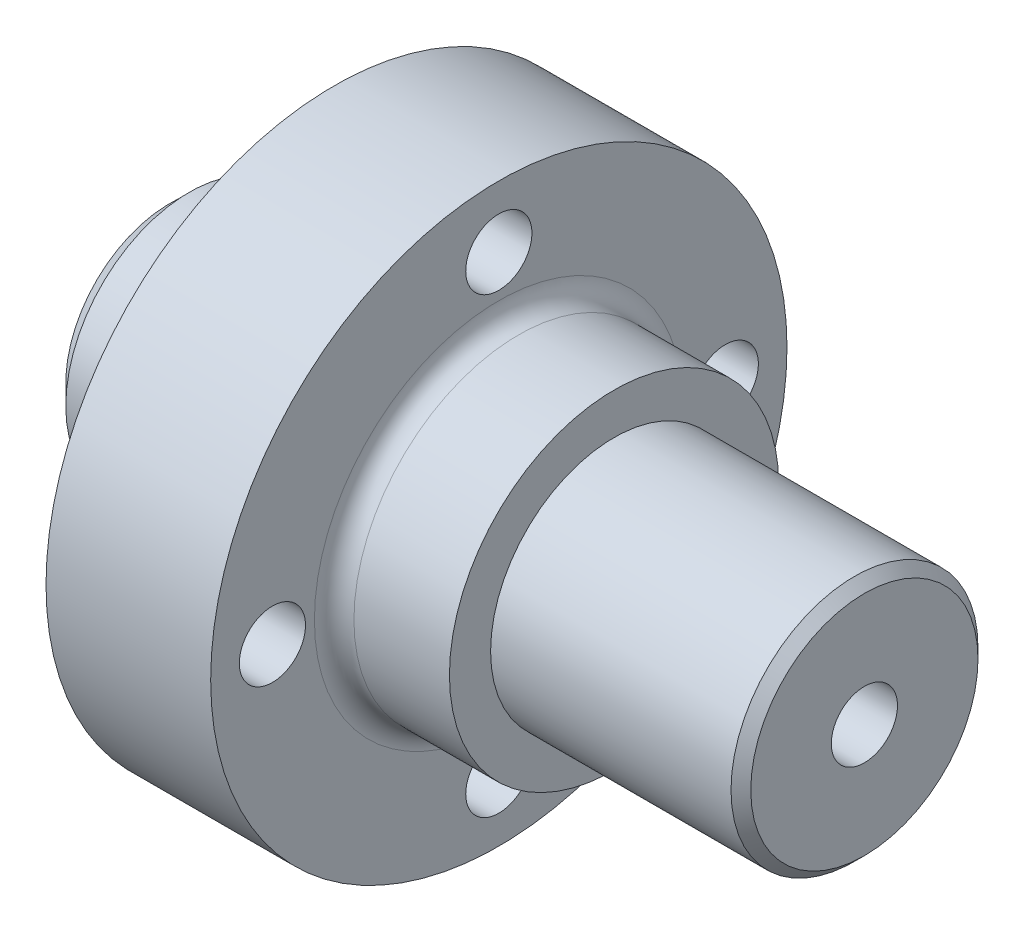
ISO-10303-21;
HEADER;
FILE_DESCRIPTION(('STEP AP214'),'2;1');
FILE_NAME('part.step','',(''),(''),'','','');
FILE_SCHEMA(('AUTOMOTIVE_DESIGN { 1 0 10303 214 1 1 1 1 }'));
ENDSEC;
DATA;
#1=APPLICATION_CONTEXT('core data for automotive mechanical design processes');
#2=APPLICATION_PROTOCOL_DEFINITION('international standard','automotive_design',2000,#1);
#3=PRODUCT_CONTEXT('',#1,'mechanical');
#4=PRODUCT('Part','Part','',(#3));
#5=PRODUCT_RELATED_PRODUCT_CATEGORY('part','',(#4));
#6=PRODUCT_DEFINITION_FORMATION('','',#4);
#7=PRODUCT_DEFINITION_CONTEXT('part definition',#1,'design');
#8=PRODUCT_DEFINITION('design','',#6,#7);
#9=PRODUCT_DEFINITION_SHAPE('','',#8);
#10=(LENGTH_UNIT() NAMED_UNIT(*) SI_UNIT(.MILLI.,.METRE.));
#11=(NAMED_UNIT(*) PLANE_ANGLE_UNIT() SI_UNIT($,.RADIAN.));
#12=(NAMED_UNIT(*) SI_UNIT($,.STERADIAN.) SOLID_ANGLE_UNIT());
#13=UNCERTAINTY_MEASURE_WITH_UNIT(LENGTH_MEASURE(1.E-05),#10,'distance_accuracy_value','');
#14=(GEOMETRIC_REPRESENTATION_CONTEXT(3) GLOBAL_UNCERTAINTY_ASSIGNED_CONTEXT((#13)) GLOBAL_UNIT_ASSIGNED_CONTEXT((#10,
#11,#12)) REPRESENTATION_CONTEXT('',''));
#15=CARTESIAN_POINT('',(0.,0.,0.));
#16=DIRECTION('',(0.,0.,1.));
#17=DIRECTION('',(1.,0.,0.));
#18=AXIS2_PLACEMENT_3D('',#15,#16,#17);
#19=CARTESIAN_POINT('',(34.29,0.,0.));
#20=DIRECTION('',(1.,0.,0.));
#21=DIRECTION('',(0.,0.,-1.));
#22=AXIS2_PLACEMENT_3D('',#19,#20,#21);
#23=PLANE('',#22);
#24=CARTESIAN_POINT('',(34.29,0.,0.));
#25=DIRECTION('',(1.,0.,0.));
#26=DIRECTION('',(0.,0.,-1.));
#27=AXIS2_PLACEMENT_3D('',#24,#25,#26);
#28=CIRCLE('',#27,12.7);
#29=CARTESIAN_POINT('',(34.29,0.,-12.7));
#30=VERTEX_POINT('',#29);
#31=EDGE_CURVE('E61',#30,#30,#28,.T.);
#32=ORIENTED_EDGE('',*,*,#31,.T.);
#33=EDGE_LOOP('',(#32));
#34=FACE_BOUND('',#33,.T.);
#35=CARTESIAN_POINT('',(34.29,0.,0.));
#36=DIRECTION('',(1.,0.,0.));
#37=DIRECTION('',(0.,0.,-1.));
#38=AXIS2_PLACEMENT_3D('',#35,#36,#37);
#39=CIRCLE('',#38,9.525);
#40=CARTESIAN_POINT('',(34.29,0.,-9.525));
#41=VERTEX_POINT('',#40);
#42=EDGE_CURVE('E57',#41,#41,#39,.T.);
#43=ORIENTED_EDGE('',*,*,#42,.F.);
#44=EDGE_LOOP('',(#43));
#45=FACE_BOUND('',#44,.T.);
#46=ADVANCED_FACE('F37',(#34,#45),#23,.T.);
#47=CARTESIAN_POINT('',(25.4,0.,0.));
#48=DIRECTION('',(1.,0.,0.));
#49=DIRECTION('',(0.,0.,-1.));
#50=AXIS2_PLACEMENT_3D('',#47,#48,#49);
#51=PLANE('',#50);
#52=CARTESIAN_POINT('',(25.4,0.,0.));
#53=DIRECTION('',(1.,0.,0.));
#54=DIRECTION('',(0.,0.,-1.));
#55=AXIS2_PLACEMENT_3D('',#52,#53,#54);
#56=CIRCLE('',#55,14.224);
#57=CARTESIAN_POINT('',(25.4,0.,-14.224));
#58=VERTEX_POINT('',#57);
#59=EDGE_CURVE('E110',#58,#58,#56,.F.);
#60=ORIENTED_EDGE('',*,*,#59,.T.);
#61=EDGE_LOOP('',(#60));
#62=FACE_BOUND('',#61,.T.);
#63=CARTESIAN_POINT('',(25.4,0.,0.));
#64=DIRECTION('',(1.,0.,0.));
#65=DIRECTION('',(0.,0.,-1.));
#66=AXIS2_PLACEMENT_3D('',#63,#64,#65);
#67=CIRCLE('',#66,22.225);
#68=CARTESIAN_POINT('',(25.4,0.,-22.225));
#69=VERTEX_POINT('',#68);
#70=EDGE_CURVE('E93',#69,#69,#67,.T.);
#71=ORIENTED_EDGE('',*,*,#70,.T.);
#72=EDGE_LOOP('',(#71));
#73=FACE_BOUND('',#72,.T.);
#74=CARTESIAN_POINT('',(25.4,0.,-17.4625));
#75=DIRECTION('',(-1.,0.,0.));
#76=DIRECTION('',(0.,0.,1.));
#77=AXIS2_PLACEMENT_3D('',#74,#75,#76);
#78=CIRCLE('',#77,2.5527);
#79=CARTESIAN_POINT('',(25.4,0.,-14.9098));
#80=VERTEX_POINT('',#79);
#81=EDGE_CURVE('E89',#80,#80,#78,.T.);
#82=ORIENTED_EDGE('',*,*,#81,.T.);
#83=EDGE_LOOP('',(#82));
#84=FACE_BOUND('',#83,.T.);
#85=CARTESIAN_POINT('',(25.4,-17.4625,0.));
#86=DIRECTION('',(-1.,0.,0.));
#87=DIRECTION('',(0.,0.,1.));
#88=AXIS2_PLACEMENT_3D('',#85,#86,#87);
#89=CIRCLE('',#88,2.5527);
#90=CARTESIAN_POINT('',(25.4,-17.4625,2.5527));
#91=VERTEX_POINT('',#90);
#92=EDGE_CURVE('E83',#91,#91,#89,.T.);
#93=ORIENTED_EDGE('',*,*,#92,.T.);
#94=EDGE_LOOP('',(#93));
#95=FACE_BOUND('',#94,.T.);
#96=CARTESIAN_POINT('',(25.4,0.,17.4625));
#97=DIRECTION('',(-1.,0.,0.));
#98=DIRECTION('',(0.,0.,1.));
#99=AXIS2_PLACEMENT_3D('',#96,#97,#98);
#100=CIRCLE('',#99,2.5527);
#101=CARTESIAN_POINT('',(25.4,0.,20.0152));
#102=VERTEX_POINT('',#101);
#103=EDGE_CURVE('E77',#102,#102,#100,.T.);
#104=ORIENTED_EDGE('',*,*,#103,.T.);
#105=EDGE_LOOP('',(#104));
#106=FACE_BOUND('',#105,.T.);
#107=CARTESIAN_POINT('',(25.4,17.4625,0.));
#108=DIRECTION('',(-1.,0.,0.));
#109=DIRECTION('',(0.,0.,1.));
#110=AXIS2_PLACEMENT_3D('',#107,#108,#109);
#111=CIRCLE('',#110,2.5527);
#112=CARTESIAN_POINT('',(25.4,17.4625,2.5527));
#113=VERTEX_POINT('',#112);
#114=EDGE_CURVE('E71',#113,#113,#111,.T.);
#115=ORIENTED_EDGE('',*,*,#114,.T.);
#116=EDGE_LOOP('',(#115));
#117=FACE_BOUND('',#116,.T.);
#118=ADVANCED_FACE('F126',(#62,#73,#84,#95,#106,#117),#51,.T.);
#119=CARTESIAN_POINT('',(12.7,0.,0.));
#120=DIRECTION('',(-1.,0.,0.));
#121=DIRECTION('',(0.,0.,1.));
#122=AXIS2_PLACEMENT_3D('',#119,#120,#121);
#123=CYLINDRICAL_SURFACE('',#122,9.525);
#124=CARTESIAN_POINT('',(1.52400000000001,0.,0.));
#125=DIRECTION('',(1.,0.,0.));
#126=DIRECTION('',(0.,0.,-1.));
#127=AXIS2_PLACEMENT_3D('',#124,#125,#126);
#128=CIRCLE('',#127,9.525);
#129=CARTESIAN_POINT('',(1.52400000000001,0.,-9.525));
#130=VERTEX_POINT('',#129);
#131=EDGE_CURVE('E101',#130,#130,#128,.T.);
#132=ORIENTED_EDGE('',*,*,#131,.T.);
#133=EDGE_LOOP('',(#132));
#134=FACE_BOUND('',#133,.T.);
#135=CARTESIAN_POINT('',(12.7,0.,0.));
#136=DIRECTION('',(1.,0.,0.));
#137=DIRECTION('',(0.,0.,-1.));
#138=AXIS2_PLACEMENT_3D('',#135,#136,#137);
#139=CIRCLE('',#138,9.525);
#140=CARTESIAN_POINT('',(12.7,0.,-9.525));
#141=VERTEX_POINT('',#140);
#142=EDGE_CURVE('E96',#141,#141,#139,.T.);
#143=ORIENTED_EDGE('',*,*,#142,.F.);
#144=EDGE_LOOP('',(#143));
#145=FACE_BOUND('',#144,.T.);
#146=ADVANCED_FACE('F134',(#134,#145),#123,.T.);
#147=CARTESIAN_POINT('',(0.,0.,0.));
#148=DIRECTION('',(1.,0.,0.));
#149=DIRECTION('',(0.,0.,-1.));
#150=AXIS2_PLACEMENT_3D('',#147,#148,#149);
#151=PLANE('',#150);
#152=CARTESIAN_POINT('',(0.,0.,0.));
#153=DIRECTION('',(1.,0.,0.));
#154=DIRECTION('',(0.,0.,-1.));
#155=AXIS2_PLACEMENT_3D('',#152,#153,#154);
#156=CIRCLE('',#155,8.00099999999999);
#157=CARTESIAN_POINT('',(0.,0.,-8.00099999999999));
#158=VERTEX_POINT('',#157);
#159=EDGE_CURVE('E104',#158,#158,#156,.F.);
#160=ORIENTED_EDGE('',*,*,#159,.T.);
#161=EDGE_LOOP('',(#160));
#162=FACE_BOUND('',#161,.T.);
#163=ADVANCED_FACE('F166',(#162),#151,.F.);
#164=CARTESIAN_POINT('',(12.7,0.,0.));
#165=DIRECTION('',(1.,0.,0.));
#166=DIRECTION('',(0.,0.,-1.));
#167=AXIS2_PLACEMENT_3D('',#164,#165,#166);
#168=PLANE('',#167);
#169=CARTESIAN_POINT('',(12.7,17.4625,0.));
#170=DIRECTION('',(-1.,0.,0.));
#171=DIRECTION('',(0.,0.,1.));
#172=AXIS2_PLACEMENT_3D('',#169,#170,#171);
#173=CIRCLE('',#172,2.55269999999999);
#174=CARTESIAN_POINT('',(12.7,17.4625,2.55269999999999));
#175=VERTEX_POINT('',#174);
#176=EDGE_CURVE('E68',#175,#175,#173,.T.);
#177=ORIENTED_EDGE('',*,*,#176,.F.);
#178=EDGE_LOOP('',(#177));
#179=FACE_BOUND('',#178,.T.);
#180=CARTESIAN_POINT('',(12.7,0.,17.4625));
#181=DIRECTION('',(-1.,0.,0.));
#182=DIRECTION('',(0.,0.,1.));
#183=AXIS2_PLACEMENT_3D('',#180,#181,#182);
#184=CIRCLE('',#183,2.55269999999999);
#185=CARTESIAN_POINT('',(12.7,0.,20.0152));
#186=VERTEX_POINT('',#185);
#187=EDGE_CURVE('E74',#186,#186,#184,.T.);
#188=ORIENTED_EDGE('',*,*,#187,.F.);
#189=EDGE_LOOP('',(#188));
#190=FACE_BOUND('',#189,.T.);
#191=CARTESIAN_POINT('',(12.7,-17.4625,0.));
#192=DIRECTION('',(-1.,0.,0.));
#193=DIRECTION('',(0.,0.,1.));
#194=AXIS2_PLACEMENT_3D('',#191,#192,#193);
#195=CIRCLE('',#194,2.55269999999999);
#196=CARTESIAN_POINT('',(12.7,-17.4625,2.55269999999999));
#197=VERTEX_POINT('',#196);
#198=EDGE_CURVE('E80',#197,#197,#195,.T.);
#199=ORIENTED_EDGE('',*,*,#198,.F.);
#200=EDGE_LOOP('',(#199));
#201=FACE_BOUND('',#200,.T.);
#202=CARTESIAN_POINT('',(12.7,0.,-17.4625));
#203=DIRECTION('',(-1.,0.,0.));
#204=DIRECTION('',(0.,0.,1.));
#205=AXIS2_PLACEMENT_3D('',#202,#203,#204);
#206=CIRCLE('',#205,2.55269999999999);
#207=CARTESIAN_POINT('',(12.7,0.,-14.9098));
#208=VERTEX_POINT('',#207);
#209=EDGE_CURVE('E86',#208,#208,#206,.T.);
#210=ORIENTED_EDGE('',*,*,#209,.F.);
#211=EDGE_LOOP('',(#210));
#212=FACE_BOUND('',#211,.T.);
#213=CARTESIAN_POINT('',(12.7,0.,0.));
#214=DIRECTION('',(1.,0.,0.));
#215=DIRECTION('',(0.,0.,-1.));
#216=AXIS2_PLACEMENT_3D('',#213,#214,#215);
#217=CIRCLE('',#216,22.225);
#218=CARTESIAN_POINT('',(12.7,0.,-22.225));
#219=VERTEX_POINT('',#218);
#220=EDGE_CURVE('E92',#219,#219,#217,.T.);
#221=ORIENTED_EDGE('',*,*,#220,.F.);
#222=EDGE_LOOP('',(#221));
#223=FACE_BOUND('',#222,.T.);
#224=ORIENTED_EDGE('',*,*,#142,.T.);
#225=EDGE_LOOP('',(#224));
#226=FACE_BOUND('',#225,.T.);
#227=ADVANCED_FACE('F163',(#179,#190,#201,#212,#223,#226),#168,.F.);
#228=CARTESIAN_POINT('',(25.4,0.,0.));
#229=DIRECTION('',(-1.,0.,0.));
#230=DIRECTION('',(0.,0.,1.));
#231=AXIS2_PLACEMENT_3D('',#228,#229,#230);
#232=CYLINDRICAL_SURFACE('',#231,22.225);
#233=ORIENTED_EDGE('',*,*,#70,.F.);
#234=EDGE_LOOP('',(#233));
#235=FACE_BOUND('',#234,.T.);
#236=ORIENTED_EDGE('',*,*,#220,.T.);
#237=EDGE_LOOP('',(#236));
#238=FACE_BOUND('',#237,.T.);
#239=ADVANCED_FACE('F160',(#235,#238),#232,.T.);
#240=CARTESIAN_POINT('',(12.7,0.,-17.4625));
#241=DIRECTION('',(-1.,0.,0.));
#242=DIRECTION('',(0.,0.,1.));
#243=AXIS2_PLACEMENT_3D('',#240,#241,#242);
#244=CYLINDRICAL_SURFACE('',#243,2.55269999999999);
#245=ORIENTED_EDGE('',*,*,#81,.F.);
#246=EDGE_LOOP('',(#245));
#247=FACE_BOUND('',#246,.T.);
#248=ORIENTED_EDGE('',*,*,#209,.T.);
#249=EDGE_LOOP('',(#248));
#250=FACE_BOUND('',#249,.T.);
#251=ADVANCED_FACE('F157',(#247,#250),#244,.F.);
#252=CARTESIAN_POINT('',(12.7,-17.4625,0.));
#253=DIRECTION('',(-1.,0.,0.));
#254=DIRECTION('',(0.,0.,1.));
#255=AXIS2_PLACEMENT_3D('',#252,#253,#254);
#256=CYLINDRICAL_SURFACE('',#255,2.55269999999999);
#257=ORIENTED_EDGE('',*,*,#92,.F.);
#258=EDGE_LOOP('',(#257));
#259=FACE_BOUND('',#258,.T.);
#260=ORIENTED_EDGE('',*,*,#198,.T.);
#261=EDGE_LOOP('',(#260));
#262=FACE_BOUND('',#261,.T.);
#263=ADVANCED_FACE('F153',(#259,#262),#256,.F.);
#264=CARTESIAN_POINT('',(12.7,0.,17.4625));
#265=DIRECTION('',(-1.,0.,0.));
#266=DIRECTION('',(0.,0.,1.));
#267=AXIS2_PLACEMENT_3D('',#264,#265,#266);
#268=CYLINDRICAL_SURFACE('',#267,2.55269999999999);
#269=ORIENTED_EDGE('',*,*,#103,.F.);
#270=EDGE_LOOP('',(#269));
#271=FACE_BOUND('',#270,.T.);
#272=ORIENTED_EDGE('',*,*,#187,.T.);
#273=EDGE_LOOP('',(#272));
#274=FACE_BOUND('',#273,.T.);
#275=ADVANCED_FACE('F149',(#271,#274),#268,.F.);
#276=CARTESIAN_POINT('',(12.7,17.4625,0.));
#277=DIRECTION('',(-1.,0.,0.));
#278=DIRECTION('',(0.,0.,1.));
#279=AXIS2_PLACEMENT_3D('',#276,#277,#278);
#280=CYLINDRICAL_SURFACE('',#279,2.55269999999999);
#281=ORIENTED_EDGE('',*,*,#114,.F.);
#282=EDGE_LOOP('',(#281));
#283=FACE_BOUND('',#282,.T.);
#284=ORIENTED_EDGE('',*,*,#176,.T.);
#285=EDGE_LOOP('',(#284));
#286=FACE_BOUND('',#285,.T.);
#287=ADVANCED_FACE('F146',(#283,#286),#280,.F.);
#288=CARTESIAN_POINT('',(1.52400000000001,0.,0.));
#289=DIRECTION('',(1.,0.,0.));
#290=DIRECTION('',(0.,0.,-1.));
#291=AXIS2_PLACEMENT_3D('',#288,#289,#290);
#292=CONICAL_SURFACE('',#291,9.525,0.785398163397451);
#293=ORIENTED_EDGE('',*,*,#159,.F.);
#294=EDGE_LOOP('',(#293));
#295=FACE_BOUND('',#294,.T.);
#296=ORIENTED_EDGE('',*,*,#131,.F.);
#297=EDGE_LOOP('',(#296));
#298=FACE_BOUND('',#297,.T.);
#299=ADVANCED_FACE('F144',(#295,#298),#292,.T.);
#300=CARTESIAN_POINT('',(34.29,0.,0.));
#301=DIRECTION('',(-1.,0.,0.));
#302=DIRECTION('',(0.,0.,1.));
#303=AXIS2_PLACEMENT_3D('',#300,#301,#302);
#304=CYLINDRICAL_SURFACE('',#303,12.7);
#305=CARTESIAN_POINT('',(26.924,0.,0.));
#306=DIRECTION('',(1.,0.,0.));
#307=DIRECTION('',(0.,0.,-1.));
#308=AXIS2_PLACEMENT_3D('',#305,#306,#307);
#309=CIRCLE('',#308,12.7);
#310=CARTESIAN_POINT('',(26.924,0.,-12.7));
#311=VERTEX_POINT('',#310);
#312=EDGE_CURVE('E107',#311,#311,#309,.T.);
#313=ORIENTED_EDGE('',*,*,#312,.T.);
#314=EDGE_LOOP('',(#313));
#315=FACE_BOUND('',#314,.T.);
#316=ORIENTED_EDGE('',*,*,#31,.F.);
#317=EDGE_LOOP('',(#316));
#318=FACE_BOUND('',#317,.T.);
#319=ADVANCED_FACE('F142',(#315,#318),#304,.T.);
#320=CARTESIAN_POINT('',(53.594,0.,0.));
#321=DIRECTION('',(-1.,0.,0.));
#322=DIRECTION('',(0.,0.,1.));
#323=AXIS2_PLACEMENT_3D('',#320,#321,#322);
#324=CYLINDRICAL_SURFACE('',#323,9.525);
#325=CARTESIAN_POINT('',(52.832,0.,0.));
#326=DIRECTION('',(1.,0.,0.));
#327=DIRECTION('',(0.,0.,-1.));
#328=AXIS2_PLACEMENT_3D('',#325,#326,#327);
#329=CIRCLE('',#328,9.525);
#330=CARTESIAN_POINT('',(52.832,0.,-9.525));
#331=VERTEX_POINT('',#330);
#332=EDGE_CURVE('E11',#331,#331,#329,.F.);
#333=ORIENTED_EDGE('',*,*,#332,.T.);
#334=EDGE_LOOP('',(#333));
#335=FACE_BOUND('',#334,.T.);
#336=ORIENTED_EDGE('',*,*,#42,.T.);
#337=EDGE_LOOP('',(#336));
#338=FACE_BOUND('',#337,.T.);
#339=ADVANCED_FACE('F140',(#335,#338),#324,.T.);
#340=CARTESIAN_POINT('',(53.594,0.,0.));
#341=DIRECTION('',(1.,0.,0.));
#342=DIRECTION('',(0.,0.,-1.));
#343=AXIS2_PLACEMENT_3D('',#340,#341,#342);
#344=PLANE('',#343);
#345=CARTESIAN_POINT('',(53.594,0.,0.));
#346=DIRECTION('',(1.,0.,0.));
#347=DIRECTION('',(0.,0.,-1.));
#348=AXIS2_PLACEMENT_3D('',#345,#346,#347);
#349=CIRCLE('',#348,8.76300000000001);
#350=CARTESIAN_POINT('',(53.594,0.,-8.76300000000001));
#351=VERTEX_POINT('',#350);
#352=EDGE_CURVE('E44',#351,#351,#349,.T.);
#353=ORIENTED_EDGE('',*,*,#352,.T.);
#354=EDGE_LOOP('',(#353));
#355=FACE_BOUND('',#354,.T.);
#356=CARTESIAN_POINT('',(53.594,0.,0.));
#357=DIRECTION('',(1.,0.,0.));
#358=DIRECTION('',(0.,0.,-1.));
#359=AXIS2_PLACEMENT_3D('',#356,#357,#358);
#360=CIRCLE('',#359,2.55269999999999);
#361=CARTESIAN_POINT('',(53.594,0.,-2.55269999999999));
#362=VERTEX_POINT('',#361);
#363=EDGE_CURVE('E58',#362,#362,#360,.T.);
#364=ORIENTED_EDGE('',*,*,#363,.F.);
#365=EDGE_LOOP('',(#364));
#366=FACE_BOUND('',#365,.T.);
#367=ADVANCED_FACE('F51',(#355,#366),#344,.T.);
#368=CARTESIAN_POINT('',(37.084,0.,0.));
#369=DIRECTION('',(1.,0.,0.));
#370=DIRECTION('',(0.,0.,-1.));
#371=AXIS2_PLACEMENT_3D('',#368,#369,#370);
#372=CONICAL_SURFACE('',#371,2.55269999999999,1.02974425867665);
#373=CARTESIAN_POINT('',(35.5501830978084,0.,0.));
#374=VERTEX_POINT('',#373);
#375=VERTEX_LOOP('',#374);
#376=FACE_BOUND('',#375,.T.);
#377=CARTESIAN_POINT('',(37.084,0.,0.));
#378=DIRECTION('',(1.,0.,0.));
#379=DIRECTION('',(0.,0.,-1.));
#380=AXIS2_PLACEMENT_3D('',#377,#378,#379);
#381=CIRCLE('',#380,2.55269999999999);
#382=CARTESIAN_POINT('',(37.084,0.,-2.55269999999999));
#383=VERTEX_POINT('',#382);
#384=EDGE_CURVE('E55',#383,#383,#381,.T.);
#385=ORIENTED_EDGE('',*,*,#384,.T.);
#386=EDGE_LOOP('',(#385));
#387=FACE_BOUND('',#386,.T.);
#388=ADVANCED_FACE('F47',(#376,#387),#372,.F.);
#389=CARTESIAN_POINT('',(53.594,0.,0.));
#390=DIRECTION('',(1.,0.,0.));
#391=DIRECTION('',(0.,0.,-1.));
#392=AXIS2_PLACEMENT_3D('',#389,#390,#391);
#393=CYLINDRICAL_SURFACE('',#392,2.55269999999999);
#394=ORIENTED_EDGE('',*,*,#384,.F.);
#395=EDGE_LOOP('',(#394));
#396=FACE_BOUND('',#395,.T.);
#397=ORIENTED_EDGE('',*,*,#363,.T.);
#398=EDGE_LOOP('',(#397));
#399=FACE_BOUND('',#398,.T.);
#400=ADVANCED_FACE('F50',(#396,#399),#393,.F.);
#401=CARTESIAN_POINT('',(26.924,0.,0.));
#402=DIRECTION('',(1.,0.,0.));
#403=DIRECTION('',(0.,0.,-1.));
#404=AXIS2_PLACEMENT_3D('',#401,#402,#403);
#405=TOROIDAL_SURFACE('',#404,14.224,1.524);
#406=ORIENTED_EDGE('',*,*,#59,.F.);
#407=EDGE_LOOP('',(#406));
#408=FACE_BOUND('',#407,.T.);
#409=ORIENTED_EDGE('',*,*,#312,.F.);
#410=EDGE_LOOP('',(#409));
#411=FACE_BOUND('',#410,.T.);
#412=ADVANCED_FACE('F118',(#408,#411),#405,.F.);
#413=CARTESIAN_POINT('',(53.594,0.,0.));
#414=DIRECTION('',(-1.,0.,0.));
#415=DIRECTION('',(0.,0.,1.));
#416=AXIS2_PLACEMENT_3D('',#413,#414,#415);
#417=CONICAL_SURFACE('',#416,8.76300000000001,0.78539816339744);
#418=ORIENTED_EDGE('',*,*,#332,.F.);
#419=EDGE_LOOP('',(#418));
#420=FACE_BOUND('',#419,.T.);
#421=ORIENTED_EDGE('',*,*,#352,.F.);
#422=EDGE_LOOP('',(#421));
#423=FACE_BOUND('',#422,.T.);
#424=ADVANCED_FACE('F39',(#420,#423),#417,.T.);
#425=CLOSED_SHELL('',(#46,#118,#146,#163,#227,#239,#251,#263,#275,#287,#299,#319,#339,#367,#388,
#400,#412,#424));
#426=MANIFOLD_SOLID_BREP('B2',#425);
#427=ADVANCED_BREP_SHAPE_REPRESENTATION('',(#18,#426),#14);
#428=SHAPE_DEFINITION_REPRESENTATION(#9,#427);
ENDSEC;
END-ISO-10303-21;
